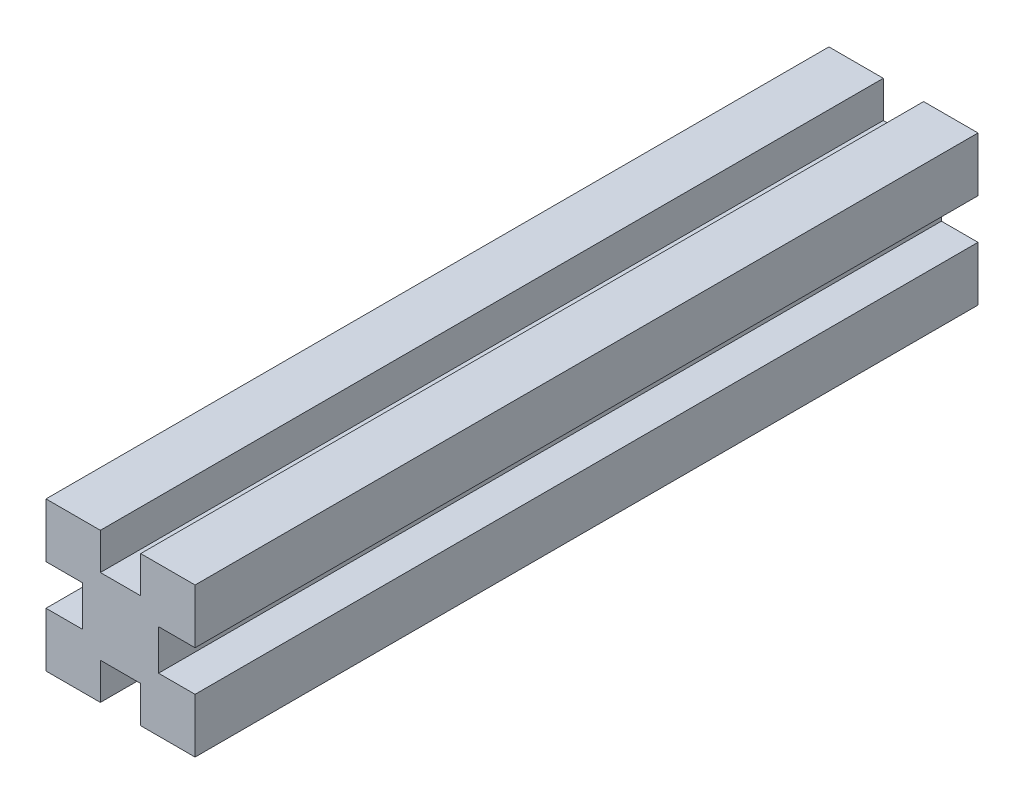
ISO-10303-21;
HEADER;
FILE_DESCRIPTION(('STEP AP214'),'2;1');
FILE_NAME('part.step','',(''),(''),'','','');
FILE_SCHEMA(('AUTOMOTIVE_DESIGN { 1 0 10303 214 1 1 1 1 }'));
ENDSEC;
DATA;
#1=APPLICATION_CONTEXT('core data for automotive mechanical design processes');
#2=APPLICATION_PROTOCOL_DEFINITION('international standard','automotive_design',2000,#1);
#3=PRODUCT_CONTEXT('',#1,'mechanical');
#4=PRODUCT('Part','Part','',(#3));
#5=PRODUCT_RELATED_PRODUCT_CATEGORY('part','',(#4));
#6=PRODUCT_DEFINITION_FORMATION('','',#4);
#7=PRODUCT_DEFINITION_CONTEXT('part definition',#1,'design');
#8=PRODUCT_DEFINITION('design','',#6,#7);
#9=PRODUCT_DEFINITION_SHAPE('','',#8);
#10=(LENGTH_UNIT() NAMED_UNIT(*) SI_UNIT(.MILLI.,.METRE.));
#11=(NAMED_UNIT(*) PLANE_ANGLE_UNIT() SI_UNIT($,.RADIAN.));
#12=(NAMED_UNIT(*) SI_UNIT($,.STERADIAN.) SOLID_ANGLE_UNIT());
#13=UNCERTAINTY_MEASURE_WITH_UNIT(LENGTH_MEASURE(1.E-05),#10,'distance_accuracy_value','');
#14=(GEOMETRIC_REPRESENTATION_CONTEXT(3) GLOBAL_UNCERTAINTY_ASSIGNED_CONTEXT((#13)) GLOBAL_UNIT_ASSIGNED_CONTEXT((#10,
#11,#12)) REPRESENTATION_CONTEXT('',''));
#15=CARTESIAN_POINT('',(0.,0.,0.));
#16=DIRECTION('',(0.,0.,1.));
#17=DIRECTION('',(1.,0.,0.));
#18=AXIS2_PLACEMENT_3D('',#15,#16,#17);
#19=CARTESIAN_POINT('',(0.,0.,167.));
#20=DIRECTION('',(0.,1.,0.));
#21=DIRECTION('',(0.,0.,1.));
#22=AXIS2_PLACEMENT_3D('',#19,#20,#21);
#23=PLANE('',#22);
#24=DIRECTION('',(1.,0.,0.));
#25=VECTOR('',#24,1.);
#26=CARTESIAN_POINT('',(0.,0.,0.));
#27=LINE('',#26,#25);
#28=CARTESIAN_POINT('',(0.,0.,0.));
#29=VERTEX_POINT('',#28);
#30=CARTESIAN_POINT('',(11.6,0.,0.));
#31=VERTEX_POINT('',#30);
#32=EDGE_CURVE('E200',#29,#31,#27,.T.);
#33=ORIENTED_EDGE('',*,*,#32,.T.);
#34=DIRECTION('',(0.,0.,-1.));
#35=VECTOR('',#34,1.);
#36=CARTESIAN_POINT('',(11.6,0.,167.));
#37=LINE('',#36,#35);
#38=CARTESIAN_POINT('',(11.6,0.,167.));
#39=VERTEX_POINT('',#38);
#40=EDGE_CURVE('E11',#39,#31,#37,.T.);
#41=ORIENTED_EDGE('',*,*,#40,.F.);
#42=DIRECTION('',(1.,0.,0.));
#43=VECTOR('',#42,1.);
#44=CARTESIAN_POINT('',(0.,0.,167.));
#45=LINE('',#44,#43);
#46=CARTESIAN_POINT('',(0.,0.,167.));
#47=VERTEX_POINT('',#46);
#48=EDGE_CURVE('E238',#47,#39,#45,.T.);
#49=ORIENTED_EDGE('',*,*,#48,.F.);
#50=DIRECTION('',(0.,0.,-1.));
#51=VECTOR('',#50,1.);
#52=CARTESIAN_POINT('',(0.,0.,167.));
#53=LINE('',#52,#51);
#54=EDGE_CURVE('E196',#47,#29,#53,.T.);
#55=ORIENTED_EDGE('',*,*,#54,.T.);
#56=EDGE_LOOP('',(#33,#41,#49,#55));
#57=FACE_BOUND('',#56,.T.);
#58=ADVANCED_FACE('F32',(#57),#23,.F.);
#59=CARTESIAN_POINT('',(11.6,0.,167.));
#60=DIRECTION('',(-1.,0.,0.));
#61=DIRECTION('',(0.,-1.,0.));
#62=AXIS2_PLACEMENT_3D('',#59,#60,#61);
#63=PLANE('',#62);
#64=DIRECTION('',(0.,1.,0.));
#65=VECTOR('',#64,1.);
#66=CARTESIAN_POINT('',(11.6,0.,0.));
#67=LINE('',#66,#65);
#68=CARTESIAN_POINT('',(11.6,7.8,0.));
#69=VERTEX_POINT('',#68);
#70=EDGE_CURVE('E203',#31,#69,#67,.T.);
#71=ORIENTED_EDGE('',*,*,#70,.T.);
#72=DIRECTION('',(0.,0.,-1.));
#73=VECTOR('',#72,1.);
#74=CARTESIAN_POINT('',(11.6,7.8,167.));
#75=LINE('',#74,#73);
#76=CARTESIAN_POINT('',(11.6,7.8,167.));
#77=VERTEX_POINT('',#76);
#78=EDGE_CURVE('E40',#77,#69,#75,.T.);
#79=ORIENTED_EDGE('',*,*,#78,.F.);
#80=DIRECTION('',(0.,1.,0.));
#81=VECTOR('',#80,1.);
#82=CARTESIAN_POINT('',(11.6,0.,167.));
#83=LINE('',#82,#81);
#84=EDGE_CURVE('E127',#39,#77,#83,.T.);
#85=ORIENTED_EDGE('',*,*,#84,.F.);
#86=ORIENTED_EDGE('',*,*,#40,.T.);
#87=EDGE_LOOP('',(#71,#79,#85,#86));
#88=FACE_BOUND('',#87,.T.);
#89=ADVANCED_FACE('F356',(#88),#63,.F.);
#90=CARTESIAN_POINT('',(11.6,7.8,167.));
#91=DIRECTION('',(0.,1.,0.));
#92=DIRECTION('',(-1.,0.,0.));
#93=AXIS2_PLACEMENT_3D('',#90,#91,#92);
#94=PLANE('',#93);
#95=DIRECTION('',(1.,0.,0.));
#96=VECTOR('',#95,1.);
#97=CARTESIAN_POINT('',(11.6,7.8,0.));
#98=LINE('',#97,#96);
#99=CARTESIAN_POINT('',(20.2,7.8,0.));
#100=VERTEX_POINT('',#99);
#101=EDGE_CURVE('E205',#69,#100,#98,.T.);
#102=ORIENTED_EDGE('',*,*,#101,.T.);
#103=DIRECTION('',(0.,0.,-1.));
#104=VECTOR('',#103,1.);
#105=CARTESIAN_POINT('',(20.2,7.8,167.));
#106=LINE('',#105,#104);
#107=CARTESIAN_POINT('',(20.2,7.8,167.));
#108=VERTEX_POINT('',#107);
#109=EDGE_CURVE('E281',#108,#100,#106,.T.);
#110=ORIENTED_EDGE('',*,*,#109,.F.);
#111=DIRECTION('',(1.,0.,0.));
#112=VECTOR('',#111,1.);
#113=CARTESIAN_POINT('',(11.6,7.8,167.));
#114=LINE('',#113,#112);
#115=EDGE_CURVE('E289',#77,#108,#114,.T.);
#116=ORIENTED_EDGE('',*,*,#115,.F.);
#117=ORIENTED_EDGE('',*,*,#78,.T.);
#118=EDGE_LOOP('',(#102,#110,#116,#117));
#119=FACE_BOUND('',#118,.T.);
#120=ADVANCED_FACE('F287',(#119),#94,.F.);
#121=CARTESIAN_POINT('',(20.2,7.8,167.));
#122=DIRECTION('',(1.,0.,0.));
#123=DIRECTION('',(0.,0.,-1.));
#124=AXIS2_PLACEMENT_3D('',#121,#122,#123);
#125=PLANE('',#124);
#126=DIRECTION('',(0.,-1.,0.));
#127=VECTOR('',#126,1.);
#128=CARTESIAN_POINT('',(20.2,7.8,0.));
#129=LINE('',#128,#127);
#130=CARTESIAN_POINT('',(20.2,0.,0.));
#131=VERTEX_POINT('',#130);
#132=EDGE_CURVE('E207',#100,#131,#129,.T.);
#133=ORIENTED_EDGE('',*,*,#132,.T.);
#134=DIRECTION('',(0.,0.,-1.));
#135=VECTOR('',#134,1.);
#136=CARTESIAN_POINT('',(20.2,0.,167.));
#137=LINE('',#136,#135);
#138=CARTESIAN_POINT('',(20.2,0.,167.));
#139=VERTEX_POINT('',#138);
#140=EDGE_CURVE('E278',#139,#131,#137,.T.);
#141=ORIENTED_EDGE('',*,*,#140,.F.);
#142=DIRECTION('',(0.,-1.,0.));
#143=VECTOR('',#142,1.);
#144=CARTESIAN_POINT('',(20.2,7.8,167.));
#145=LINE('',#144,#143);
#146=EDGE_CURVE('E307',#108,#139,#145,.T.);
#147=ORIENTED_EDGE('',*,*,#146,.F.);
#148=ORIENTED_EDGE('',*,*,#109,.T.);
#149=EDGE_LOOP('',(#133,#141,#147,#148));
#150=FACE_BOUND('',#149,.T.);
#151=ADVANCED_FACE('F298',(#150),#125,.F.);
#152=CARTESIAN_POINT('',(20.2,0.,167.));
#153=DIRECTION('',(0.,1.,0.));
#154=DIRECTION('',(0.,0.,1.));
#155=AXIS2_PLACEMENT_3D('',#152,#153,#154);
#156=PLANE('',#155);
#157=DIRECTION('',(1.,0.,0.));
#158=VECTOR('',#157,1.);
#159=CARTESIAN_POINT('',(20.2,0.,0.));
#160=LINE('',#159,#158);
#161=CARTESIAN_POINT('',(31.8,0.,0.));
#162=VERTEX_POINT('',#161);
#163=EDGE_CURVE('E209',#131,#162,#160,.T.);
#164=ORIENTED_EDGE('',*,*,#163,.T.);
#165=DIRECTION('',(0.,0.,-1.));
#166=VECTOR('',#165,1.);
#167=CARTESIAN_POINT('',(31.8,0.,167.));
#168=LINE('',#167,#166);
#169=CARTESIAN_POINT('',(31.8,0.,167.));
#170=VERTEX_POINT('',#169);
#171=EDGE_CURVE('E275',#170,#162,#168,.T.);
#172=ORIENTED_EDGE('',*,*,#171,.F.);
#173=DIRECTION('',(1.,0.,0.));
#174=VECTOR('',#173,1.);
#175=CARTESIAN_POINT('',(20.2,0.,167.));
#176=LINE('',#175,#174);
#177=EDGE_CURVE('E304',#139,#170,#176,.T.);
#178=ORIENTED_EDGE('',*,*,#177,.F.);
#179=ORIENTED_EDGE('',*,*,#140,.T.);
#180=EDGE_LOOP('',(#164,#172,#178,#179));
#181=FACE_BOUND('',#180,.T.);
#182=ADVANCED_FACE('F302',(#181),#156,.F.);
#183=CARTESIAN_POINT('',(31.8,11.6,167.));
#184=DIRECTION('',(-1.,0.,0.));
#185=DIRECTION('',(0.,0.,1.));
#186=AXIS2_PLACEMENT_3D('',#183,#184,#185);
#187=PLANE('',#186);
#188=DIRECTION('',(0.,1.,0.));
#189=VECTOR('',#188,1.);
#190=CARTESIAN_POINT('',(31.8,11.6,0.));
#191=LINE('',#190,#189);
#192=CARTESIAN_POINT('',(31.8,11.6,0.));
#193=VERTEX_POINT('',#192);
#194=EDGE_CURVE('E211',#162,#193,#191,.T.);
#195=ORIENTED_EDGE('',*,*,#194,.T.);
#196=DIRECTION('',(0.,0.,-1.));
#197=VECTOR('',#196,1.);
#198=CARTESIAN_POINT('',(31.8,11.6,167.));
#199=LINE('',#198,#197);
#200=CARTESIAN_POINT('',(31.8,11.6,167.));
#201=VERTEX_POINT('',#200);
#202=EDGE_CURVE('E272',#201,#193,#199,.T.);
#203=ORIENTED_EDGE('',*,*,#202,.F.);
#204=DIRECTION('',(0.,1.,0.));
#205=VECTOR('',#204,1.);
#206=CARTESIAN_POINT('',(31.8,11.6,167.));
#207=LINE('',#206,#205);
#208=EDGE_CURVE('E306',#170,#201,#207,.T.);
#209=ORIENTED_EDGE('',*,*,#208,.F.);
#210=ORIENTED_EDGE('',*,*,#171,.T.);
#211=EDGE_LOOP('',(#195,#203,#209,#210));
#212=FACE_BOUND('',#211,.T.);
#213=ADVANCED_FACE('F369',(#212),#187,.F.);
#214=CARTESIAN_POINT('',(24.,11.6,167.));
#215=DIRECTION('',(0.,-1.,0.));
#216=DIRECTION('',(0.,0.,-1.));
#217=AXIS2_PLACEMENT_3D('',#214,#215,#216);
#218=PLANE('',#217);
#219=DIRECTION('',(-1.,0.,0.));
#220=VECTOR('',#219,1.);
#221=CARTESIAN_POINT('',(24.,11.6,0.));
#222=LINE('',#221,#220);
#223=CARTESIAN_POINT('',(24.,11.6,0.));
#224=VERTEX_POINT('',#223);
#225=EDGE_CURVE('E213',#193,#224,#222,.T.);
#226=ORIENTED_EDGE('',*,*,#225,.T.);
#227=DIRECTION('',(0.,0.,-1.));
#228=VECTOR('',#227,1.);
#229=CARTESIAN_POINT('',(24.,11.6,167.));
#230=LINE('',#229,#228);
#231=CARTESIAN_POINT('',(24.,11.6,167.));
#232=VERTEX_POINT('',#231);
#233=EDGE_CURVE('E269',#232,#224,#230,.T.);
#234=ORIENTED_EDGE('',*,*,#233,.F.);
#235=DIRECTION('',(-1.,0.,0.));
#236=VECTOR('',#235,1.);
#237=CARTESIAN_POINT('',(24.,11.6,167.));
#238=LINE('',#237,#236);
#239=EDGE_CURVE('E309',#201,#232,#238,.T.);
#240=ORIENTED_EDGE('',*,*,#239,.F.);
#241=ORIENTED_EDGE('',*,*,#202,.T.);
#242=EDGE_LOOP('',(#226,#234,#240,#241));
#243=FACE_BOUND('',#242,.T.);
#244=ADVANCED_FACE('F372',(#243),#218,.F.);
#245=CARTESIAN_POINT('',(24.,20.2,167.));
#246=DIRECTION('',(-1.,0.,0.));
#247=DIRECTION('',(0.,0.,1.));
#248=AXIS2_PLACEMENT_3D('',#245,#246,#247);
#249=PLANE('',#248);
#250=DIRECTION('',(0.,1.,0.));
#251=VECTOR('',#250,1.);
#252=CARTESIAN_POINT('',(24.,20.2,0.));
#253=LINE('',#252,#251);
#254=CARTESIAN_POINT('',(24.,20.2,0.));
#255=VERTEX_POINT('',#254);
#256=EDGE_CURVE('E215',#224,#255,#253,.T.);
#257=ORIENTED_EDGE('',*,*,#256,.T.);
#258=DIRECTION('',(0.,0.,-1.));
#259=VECTOR('',#258,1.);
#260=CARTESIAN_POINT('',(24.,20.2,167.));
#261=LINE('',#260,#259);
#262=CARTESIAN_POINT('',(24.,20.2,167.));
#263=VERTEX_POINT('',#262);
#264=EDGE_CURVE('E266',#263,#255,#261,.T.);
#265=ORIENTED_EDGE('',*,*,#264,.F.);
#266=DIRECTION('',(0.,1.,0.));
#267=VECTOR('',#266,1.);
#268=CARTESIAN_POINT('',(24.,20.2,167.));
#269=LINE('',#268,#267);
#270=EDGE_CURVE('E315',#232,#263,#269,.T.);
#271=ORIENTED_EDGE('',*,*,#270,.F.);
#272=ORIENTED_EDGE('',*,*,#233,.T.);
#273=EDGE_LOOP('',(#257,#265,#271,#272));
#274=FACE_BOUND('',#273,.T.);
#275=ADVANCED_FACE('F376',(#274),#249,.F.);
#276=CARTESIAN_POINT('',(31.8,20.2,167.));
#277=DIRECTION('',(0.,1.,0.));
#278=DIRECTION('',(0.,0.,1.));
#279=AXIS2_PLACEMENT_3D('',#276,#277,#278);
#280=PLANE('',#279);
#281=DIRECTION('',(1.,0.,0.));
#282=VECTOR('',#281,1.);
#283=CARTESIAN_POINT('',(31.8,20.2,0.));
#284=LINE('',#283,#282);
#285=CARTESIAN_POINT('',(31.8,20.2,0.));
#286=VERTEX_POINT('',#285);
#287=EDGE_CURVE('E217',#255,#286,#284,.T.);
#288=ORIENTED_EDGE('',*,*,#287,.T.);
#289=DIRECTION('',(0.,0.,-1.));
#290=VECTOR('',#289,1.);
#291=CARTESIAN_POINT('',(31.8,20.2,167.));
#292=LINE('',#291,#290);
#293=CARTESIAN_POINT('',(31.8,20.2,167.));
#294=VERTEX_POINT('',#293);
#295=EDGE_CURVE('E263',#294,#286,#292,.T.);
#296=ORIENTED_EDGE('',*,*,#295,.F.);
#297=DIRECTION('',(1.,0.,0.));
#298=VECTOR('',#297,1.);
#299=CARTESIAN_POINT('',(31.8,20.2,167.));
#300=LINE('',#299,#298);
#301=EDGE_CURVE('E317',#263,#294,#300,.T.);
#302=ORIENTED_EDGE('',*,*,#301,.F.);
#303=ORIENTED_EDGE('',*,*,#264,.T.);
#304=EDGE_LOOP('',(#288,#296,#302,#303));
#305=FACE_BOUND('',#304,.T.);
#306=ADVANCED_FACE('F380',(#305),#280,.F.);
#307=CARTESIAN_POINT('',(31.8,31.8,167.));
#308=DIRECTION('',(-1.,0.,0.));
#309=DIRECTION('',(0.,-1.,0.));
#310=AXIS2_PLACEMENT_3D('',#307,#308,#309);
#311=PLANE('',#310);
#312=DIRECTION('',(0.,1.,0.));
#313=VECTOR('',#312,1.);
#314=CARTESIAN_POINT('',(31.8,31.8,0.));
#315=LINE('',#314,#313);
#316=CARTESIAN_POINT('',(31.8,31.8,0.));
#317=VERTEX_POINT('',#316);
#318=EDGE_CURVE('E219',#286,#317,#315,.T.);
#319=ORIENTED_EDGE('',*,*,#318,.T.);
#320=DIRECTION('',(0.,0.,-1.));
#321=VECTOR('',#320,1.);
#322=CARTESIAN_POINT('',(31.8,31.8,167.));
#323=LINE('',#322,#321);
#324=CARTESIAN_POINT('',(31.8,31.8,167.));
#325=VERTEX_POINT('',#324);
#326=EDGE_CURVE('E260',#325,#317,#323,.T.);
#327=ORIENTED_EDGE('',*,*,#326,.F.);
#328=DIRECTION('',(0.,1.,0.));
#329=VECTOR('',#328,1.);
#330=CARTESIAN_POINT('',(31.8,31.8,167.));
#331=LINE('',#330,#329);
#332=EDGE_CURVE('E319',#294,#325,#331,.T.);
#333=ORIENTED_EDGE('',*,*,#332,.F.);
#334=ORIENTED_EDGE('',*,*,#295,.T.);
#335=EDGE_LOOP('',(#319,#327,#333,#334));
#336=FACE_BOUND('',#335,.T.);
#337=ADVANCED_FACE('F384',(#336),#311,.F.);
#338=CARTESIAN_POINT('',(20.2,31.8,167.));
#339=DIRECTION('',(0.,-1.,0.));
#340=DIRECTION('',(0.,0.,-1.));
#341=AXIS2_PLACEMENT_3D('',#338,#339,#340);
#342=PLANE('',#341);
#343=DIRECTION('',(-1.,0.,0.));
#344=VECTOR('',#343,1.);
#345=CARTESIAN_POINT('',(20.2,31.8,0.));
#346=LINE('',#345,#344);
#347=CARTESIAN_POINT('',(20.2,31.8,0.));
#348=VERTEX_POINT('',#347);
#349=EDGE_CURVE('E221',#317,#348,#346,.T.);
#350=ORIENTED_EDGE('',*,*,#349,.T.);
#351=DIRECTION('',(0.,0.,-1.));
#352=VECTOR('',#351,1.);
#353=CARTESIAN_POINT('',(20.2,31.8,167.));
#354=LINE('',#353,#352);
#355=CARTESIAN_POINT('',(20.2,31.8,167.));
#356=VERTEX_POINT('',#355);
#357=EDGE_CURVE('E257',#356,#348,#354,.T.);
#358=ORIENTED_EDGE('',*,*,#357,.F.);
#359=DIRECTION('',(-1.,0.,0.));
#360=VECTOR('',#359,1.);
#361=CARTESIAN_POINT('',(20.2,31.8,167.));
#362=LINE('',#361,#360);
#363=EDGE_CURVE('E321',#325,#356,#362,.T.);
#364=ORIENTED_EDGE('',*,*,#363,.F.);
#365=ORIENTED_EDGE('',*,*,#326,.T.);
#366=EDGE_LOOP('',(#350,#358,#364,#365));
#367=FACE_BOUND('',#366,.T.);
#368=ADVANCED_FACE('F388',(#367),#342,.F.);
#369=CARTESIAN_POINT('',(20.2,24.,167.));
#370=DIRECTION('',(1.,0.,0.));
#371=DIRECTION('',(0.,1.,0.));
#372=AXIS2_PLACEMENT_3D('',#369,#370,#371);
#373=PLANE('',#372);
#374=DIRECTION('',(0.,-1.,0.));
#375=VECTOR('',#374,1.);
#376=CARTESIAN_POINT('',(20.2,24.,0.));
#377=LINE('',#376,#375);
#378=CARTESIAN_POINT('',(20.2,24.,0.));
#379=VERTEX_POINT('',#378);
#380=EDGE_CURVE('E223',#348,#379,#377,.T.);
#381=ORIENTED_EDGE('',*,*,#380,.T.);
#382=DIRECTION('',(0.,0.,-1.));
#383=VECTOR('',#382,1.);
#384=CARTESIAN_POINT('',(20.2,24.,167.));
#385=LINE('',#384,#383);
#386=CARTESIAN_POINT('',(20.2,24.,167.));
#387=VERTEX_POINT('',#386);
#388=EDGE_CURVE('E254',#387,#379,#385,.T.);
#389=ORIENTED_EDGE('',*,*,#388,.F.);
#390=DIRECTION('',(0.,-1.,0.));
#391=VECTOR('',#390,1.);
#392=CARTESIAN_POINT('',(20.2,24.,167.));
#393=LINE('',#392,#391);
#394=EDGE_CURVE('E323',#356,#387,#393,.T.);
#395=ORIENTED_EDGE('',*,*,#394,.F.);
#396=ORIENTED_EDGE('',*,*,#357,.T.);
#397=EDGE_LOOP('',(#381,#389,#395,#396));
#398=FACE_BOUND('',#397,.T.);
#399=ADVANCED_FACE('F392',(#398),#373,.F.);
#400=CARTESIAN_POINT('',(11.6,24.,167.));
#401=DIRECTION('',(0.,-1.,0.));
#402=DIRECTION('',(0.,0.,-1.));
#403=AXIS2_PLACEMENT_3D('',#400,#401,#402);
#404=PLANE('',#403);
#405=DIRECTION('',(-1.,0.,0.));
#406=VECTOR('',#405,1.);
#407=CARTESIAN_POINT('',(11.6,24.,0.));
#408=LINE('',#407,#406);
#409=CARTESIAN_POINT('',(11.6,24.,0.));
#410=VERTEX_POINT('',#409);
#411=EDGE_CURVE('E225',#379,#410,#408,.T.);
#412=ORIENTED_EDGE('',*,*,#411,.T.);
#413=DIRECTION('',(0.,0.,-1.));
#414=VECTOR('',#413,1.);
#415=CARTESIAN_POINT('',(11.6,24.,167.));
#416=LINE('',#415,#414);
#417=CARTESIAN_POINT('',(11.6,24.,167.));
#418=VERTEX_POINT('',#417);
#419=EDGE_CURVE('E251',#418,#410,#416,.T.);
#420=ORIENTED_EDGE('',*,*,#419,.F.);
#421=DIRECTION('',(-1.,0.,0.));
#422=VECTOR('',#421,1.);
#423=CARTESIAN_POINT('',(11.6,24.,167.));
#424=LINE('',#423,#422);
#425=EDGE_CURVE('E325',#387,#418,#424,.T.);
#426=ORIENTED_EDGE('',*,*,#425,.F.);
#427=ORIENTED_EDGE('',*,*,#388,.T.);
#428=EDGE_LOOP('',(#412,#420,#426,#427));
#429=FACE_BOUND('',#428,.T.);
#430=ADVANCED_FACE('F396',(#429),#404,.F.);
#431=CARTESIAN_POINT('',(11.6,31.8,167.));
#432=DIRECTION('',(-1.,0.,0.));
#433=DIRECTION('',(0.,-1.,0.));
#434=AXIS2_PLACEMENT_3D('',#431,#432,#433);
#435=PLANE('',#434);
#436=DIRECTION('',(0.,1.,0.));
#437=VECTOR('',#436,1.);
#438=CARTESIAN_POINT('',(11.6,31.8,0.));
#439=LINE('',#438,#437);
#440=CARTESIAN_POINT('',(11.6,31.8,0.));
#441=VERTEX_POINT('',#440);
#442=EDGE_CURVE('E227',#410,#441,#439,.T.);
#443=ORIENTED_EDGE('',*,*,#442,.T.);
#444=DIRECTION('',(0.,0.,-1.));
#445=VECTOR('',#444,1.);
#446=CARTESIAN_POINT('',(11.6,31.8,167.));
#447=LINE('',#446,#445);
#448=CARTESIAN_POINT('',(11.6,31.8,167.));
#449=VERTEX_POINT('',#448);
#450=EDGE_CURVE('E248',#449,#441,#447,.T.);
#451=ORIENTED_EDGE('',*,*,#450,.F.);
#452=DIRECTION('',(0.,1.,0.));
#453=VECTOR('',#452,1.);
#454=CARTESIAN_POINT('',(11.6,31.8,167.));
#455=LINE('',#454,#453);
#456=EDGE_CURVE('E327',#418,#449,#455,.T.);
#457=ORIENTED_EDGE('',*,*,#456,.F.);
#458=ORIENTED_EDGE('',*,*,#419,.T.);
#459=EDGE_LOOP('',(#443,#451,#457,#458));
#460=FACE_BOUND('',#459,.T.);
#461=ADVANCED_FACE('F400',(#460),#435,.F.);
#462=CARTESIAN_POINT('',(0.,31.8,167.));
#463=DIRECTION('',(0.,-1.,0.));
#464=DIRECTION('',(0.,0.,-1.));
#465=AXIS2_PLACEMENT_3D('',#462,#463,#464);
#466=PLANE('',#465);
#467=DIRECTION('',(-1.,0.,0.));
#468=VECTOR('',#467,1.);
#469=CARTESIAN_POINT('',(0.,31.8,0.));
#470=LINE('',#469,#468);
#471=CARTESIAN_POINT('',(0.,31.8,0.));
#472=VERTEX_POINT('',#471);
#473=EDGE_CURVE('E229',#441,#472,#470,.T.);
#474=ORIENTED_EDGE('',*,*,#473,.T.);
#475=DIRECTION('',(0.,0.,-1.));
#476=VECTOR('',#475,1.);
#477=CARTESIAN_POINT('',(0.,31.8,167.));
#478=LINE('',#477,#476);
#479=CARTESIAN_POINT('',(0.,31.8,167.));
#480=VERTEX_POINT('',#479);
#481=EDGE_CURVE('E245',#480,#472,#478,.T.);
#482=ORIENTED_EDGE('',*,*,#481,.F.);
#483=DIRECTION('',(-1.,0.,0.));
#484=VECTOR('',#483,1.);
#485=CARTESIAN_POINT('',(0.,31.8,167.));
#486=LINE('',#485,#484);
#487=EDGE_CURVE('E329',#449,#480,#486,.T.);
#488=ORIENTED_EDGE('',*,*,#487,.F.);
#489=ORIENTED_EDGE('',*,*,#450,.T.);
#490=EDGE_LOOP('',(#474,#482,#488,#489));
#491=FACE_BOUND('',#490,.T.);
#492=ADVANCED_FACE('F404',(#491),#466,.F.);
#493=CARTESIAN_POINT('',(0.,20.2,167.));
#494=DIRECTION('',(1.,0.,0.));
#495=DIRECTION('',(0.,1.,0.));
#496=AXIS2_PLACEMENT_3D('',#493,#494,#495);
#497=PLANE('',#496);
#498=DIRECTION('',(0.,-1.,0.));
#499=VECTOR('',#498,1.);
#500=CARTESIAN_POINT('',(0.,20.2,0.));
#501=LINE('',#500,#499);
#502=CARTESIAN_POINT('',(0.,20.2,0.));
#503=VERTEX_POINT('',#502);
#504=EDGE_CURVE('E231',#472,#503,#501,.T.);
#505=ORIENTED_EDGE('',*,*,#504,.T.);
#506=DIRECTION('',(0.,0.,-1.));
#507=VECTOR('',#506,1.);
#508=CARTESIAN_POINT('',(0.,20.2,167.));
#509=LINE('',#508,#507);
#510=CARTESIAN_POINT('',(0.,20.2,167.));
#511=VERTEX_POINT('',#510);
#512=EDGE_CURVE('E242',#511,#503,#509,.T.);
#513=ORIENTED_EDGE('',*,*,#512,.F.);
#514=DIRECTION('',(0.,-1.,0.));
#515=VECTOR('',#514,1.);
#516=CARTESIAN_POINT('',(0.,20.2,167.));
#517=LINE('',#516,#515);
#518=EDGE_CURVE('E331',#480,#511,#517,.T.);
#519=ORIENTED_EDGE('',*,*,#518,.F.);
#520=ORIENTED_EDGE('',*,*,#481,.T.);
#521=EDGE_LOOP('',(#505,#513,#519,#520));
#522=FACE_BOUND('',#521,.T.);
#523=ADVANCED_FACE('F337',(#522),#497,.F.);
#524=CARTESIAN_POINT('',(7.80000000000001,20.2,167.));
#525=DIRECTION('',(0.,1.,0.));
#526=DIRECTION('',(-1.,0.,0.));
#527=AXIS2_PLACEMENT_3D('',#524,#525,#526);
#528=PLANE('',#527);
#529=DIRECTION('',(1.,0.,0.));
#530=VECTOR('',#529,1.);
#531=CARTESIAN_POINT('',(7.80000000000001,20.2,0.));
#532=LINE('',#531,#530);
#533=CARTESIAN_POINT('',(7.80000000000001,20.2,0.));
#534=VERTEX_POINT('',#533);
#535=EDGE_CURVE('E233',#503,#534,#532,.T.);
#536=ORIENTED_EDGE('',*,*,#535,.T.);
#537=DIRECTION('',(0.,0.,-1.));
#538=VECTOR('',#537,1.);
#539=CARTESIAN_POINT('',(7.80000000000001,20.2,167.));
#540=LINE('',#539,#538);
#541=CARTESIAN_POINT('',(7.80000000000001,20.2,167.));
#542=VERTEX_POINT('',#541);
#543=EDGE_CURVE('E191',#542,#534,#540,.T.);
#544=ORIENTED_EDGE('',*,*,#543,.F.);
#545=DIRECTION('',(1.,0.,0.));
#546=VECTOR('',#545,1.);
#547=CARTESIAN_POINT('',(7.80000000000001,20.2,167.));
#548=LINE('',#547,#546);
#549=EDGE_CURVE('E182',#511,#542,#548,.T.);
#550=ORIENTED_EDGE('',*,*,#549,.F.);
#551=ORIENTED_EDGE('',*,*,#512,.T.);
#552=EDGE_LOOP('',(#536,#544,#550,#551));
#553=FACE_BOUND('',#552,.T.);
#554=ADVANCED_FACE('F341',(#553),#528,.F.);
#555=CARTESIAN_POINT('',(7.80000000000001,11.6,167.));
#556=DIRECTION('',(1.,0.,0.));
#557=DIRECTION('',(0.,0.,-1.));
#558=AXIS2_PLACEMENT_3D('',#555,#556,#557);
#559=PLANE('',#558);
#560=DIRECTION('',(0.,-1.,0.));
#561=VECTOR('',#560,1.);
#562=CARTESIAN_POINT('',(7.80000000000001,11.6,0.));
#563=LINE('',#562,#561);
#564=CARTESIAN_POINT('',(7.80000000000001,11.6,0.));
#565=VERTEX_POINT('',#564);
#566=EDGE_CURVE('E190',#534,#565,#563,.T.);
#567=ORIENTED_EDGE('',*,*,#566,.T.);
#568=DIRECTION('',(0.,0.,-1.));
#569=VECTOR('',#568,1.);
#570=CARTESIAN_POINT('',(7.80000000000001,11.6,167.));
#571=LINE('',#570,#569);
#572=CARTESIAN_POINT('',(7.80000000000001,11.6,167.));
#573=VERTEX_POINT('',#572);
#574=EDGE_CURVE('E187',#573,#565,#571,.T.);
#575=ORIENTED_EDGE('',*,*,#574,.F.);
#576=DIRECTION('',(0.,-1.,0.));
#577=VECTOR('',#576,1.);
#578=CARTESIAN_POINT('',(7.80000000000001,11.6,167.));
#579=LINE('',#578,#577);
#580=EDGE_CURVE('E176',#542,#573,#579,.T.);
#581=ORIENTED_EDGE('',*,*,#580,.F.);
#582=ORIENTED_EDGE('',*,*,#543,.T.);
#583=EDGE_LOOP('',(#567,#575,#581,#582));
#584=FACE_BOUND('',#583,.T.);
#585=ADVANCED_FACE('F188',(#584),#559,.F.);
#586=CARTESIAN_POINT('',(0.,11.6,167.));
#587=DIRECTION('',(0.,-1.,0.));
#588=DIRECTION('',(0.,0.,-1.));
#589=AXIS2_PLACEMENT_3D('',#586,#587,#588);
#590=PLANE('',#589);
#591=DIRECTION('',(-1.,0.,0.));
#592=VECTOR('',#591,1.);
#593=CARTESIAN_POINT('',(0.,11.6,0.));
#594=LINE('',#593,#592);
#595=CARTESIAN_POINT('',(0.,11.6,0.));
#596=VERTEX_POINT('',#595);
#597=EDGE_CURVE('E113',#565,#596,#594,.T.);
#598=ORIENTED_EDGE('',*,*,#597,.T.);
#599=DIRECTION('',(0.,0.,-1.));
#600=VECTOR('',#599,1.);
#601=CARTESIAN_POINT('',(0.,11.6,167.));
#602=LINE('',#601,#600);
#603=CARTESIAN_POINT('',(0.,11.6,167.));
#604=VERTEX_POINT('',#603);
#605=EDGE_CURVE('E192',#604,#596,#602,.T.);
#606=ORIENTED_EDGE('',*,*,#605,.F.);
#607=DIRECTION('',(-1.,0.,0.));
#608=VECTOR('',#607,1.);
#609=CARTESIAN_POINT('',(0.,11.6,167.));
#610=LINE('',#609,#608);
#611=EDGE_CURVE('E180',#573,#604,#610,.T.);
#612=ORIENTED_EDGE('',*,*,#611,.F.);
#613=ORIENTED_EDGE('',*,*,#574,.T.);
#614=EDGE_LOOP('',(#598,#606,#612,#613));
#615=FACE_BOUND('',#614,.T.);
#616=ADVANCED_FACE('F194',(#615),#590,.F.);
#617=CARTESIAN_POINT('',(0.,0.,167.));
#618=DIRECTION('',(1.,0.,0.));
#619=DIRECTION('',(0.,1.,0.));
#620=AXIS2_PLACEMENT_3D('',#617,#618,#619);
#621=PLANE('',#620);
#622=DIRECTION('',(0.,-1.,0.));
#623=VECTOR('',#622,1.);
#624=CARTESIAN_POINT('',(0.,0.,0.));
#625=LINE('',#624,#623);
#626=EDGE_CURVE('E119',#596,#29,#625,.T.);
#627=ORIENTED_EDGE('',*,*,#626,.T.);
#628=ORIENTED_EDGE('',*,*,#54,.F.);
#629=DIRECTION('',(0.,-1.,0.));
#630=VECTOR('',#629,1.);
#631=CARTESIAN_POINT('',(0.,0.,167.));
#632=LINE('',#631,#630);
#633=EDGE_CURVE('E48',#604,#47,#632,.T.);
#634=ORIENTED_EDGE('',*,*,#633,.F.);
#635=ORIENTED_EDGE('',*,*,#605,.T.);
#636=EDGE_LOOP('',(#627,#628,#634,#635));
#637=FACE_BOUND('',#636,.T.);
#638=ADVANCED_FACE('F345',(#637),#621,.F.);
#639=CARTESIAN_POINT('',(0.,0.,167.));
#640=DIRECTION('',(0.,0.,1.));
#641=DIRECTION('',(1.,0.,0.));
#642=AXIS2_PLACEMENT_3D('',#639,#640,#641);
#643=PLANE('',#642);
#644=ORIENTED_EDGE('',*,*,#48,.T.);
#645=ORIENTED_EDGE('',*,*,#84,.T.);
#646=ORIENTED_EDGE('',*,*,#115,.T.);
#647=ORIENTED_EDGE('',*,*,#146,.T.);
#648=ORIENTED_EDGE('',*,*,#177,.T.);
#649=ORIENTED_EDGE('',*,*,#208,.T.);
#650=ORIENTED_EDGE('',*,*,#239,.T.);
#651=ORIENTED_EDGE('',*,*,#270,.T.);
#652=ORIENTED_EDGE('',*,*,#301,.T.);
#653=ORIENTED_EDGE('',*,*,#332,.T.);
#654=ORIENTED_EDGE('',*,*,#363,.T.);
#655=ORIENTED_EDGE('',*,*,#394,.T.);
#656=ORIENTED_EDGE('',*,*,#425,.T.);
#657=ORIENTED_EDGE('',*,*,#456,.T.);
#658=ORIENTED_EDGE('',*,*,#487,.T.);
#659=ORIENTED_EDGE('',*,*,#518,.T.);
#660=ORIENTED_EDGE('',*,*,#549,.T.);
#661=ORIENTED_EDGE('',*,*,#580,.T.);
#662=ORIENTED_EDGE('',*,*,#611,.T.);
#663=ORIENTED_EDGE('',*,*,#633,.T.);
#664=EDGE_LOOP('',(#644,#645,#646,#647,#648,#649,#650,#651,#652,#653,#654,#655,#656,#657,#658,
#659,#660,#661,#662,#663));
#665=FACE_BOUND('',#664,.T.);
#666=ADVANCED_FACE('F178',(#665),#643,.T.);
#667=CARTESIAN_POINT('',(0.,0.,0.));
#668=DIRECTION('',(0.,0.,1.));
#669=DIRECTION('',(1.,0.,0.));
#670=AXIS2_PLACEMENT_3D('',#667,#668,#669);
#671=PLANE('',#670);
#672=ORIENTED_EDGE('',*,*,#32,.F.);
#673=ORIENTED_EDGE('',*,*,#626,.F.);
#674=ORIENTED_EDGE('',*,*,#597,.F.);
#675=ORIENTED_EDGE('',*,*,#566,.F.);
#676=ORIENTED_EDGE('',*,*,#535,.F.);
#677=ORIENTED_EDGE('',*,*,#504,.F.);
#678=ORIENTED_EDGE('',*,*,#473,.F.);
#679=ORIENTED_EDGE('',*,*,#442,.F.);
#680=ORIENTED_EDGE('',*,*,#411,.F.);
#681=ORIENTED_EDGE('',*,*,#380,.F.);
#682=ORIENTED_EDGE('',*,*,#349,.F.);
#683=ORIENTED_EDGE('',*,*,#318,.F.);
#684=ORIENTED_EDGE('',*,*,#287,.F.);
#685=ORIENTED_EDGE('',*,*,#256,.F.);
#686=ORIENTED_EDGE('',*,*,#225,.F.);
#687=ORIENTED_EDGE('',*,*,#194,.F.);
#688=ORIENTED_EDGE('',*,*,#163,.F.);
#689=ORIENTED_EDGE('',*,*,#132,.F.);
#690=ORIENTED_EDGE('',*,*,#101,.F.);
#691=ORIENTED_EDGE('',*,*,#70,.F.);
#692=EDGE_LOOP('',(#672,#673,#674,#675,#676,#677,#678,#679,#680,#681,#682,#683,#684,#685,#686,
#687,#688,#689,#690,#691));
#693=FACE_BOUND('',#692,.T.);
#694=ADVANCED_FACE('F293',(#693),#671,.F.);
#695=CLOSED_SHELL('',(#58,#89,#120,#151,#182,#213,#244,#275,#306,#337,#368,#399,#430,#461,#492,
#523,#554,#585,#616,#638,#666,#694));
#696=MANIFOLD_SOLID_BREP('B2',#695);
#697=ADVANCED_BREP_SHAPE_REPRESENTATION('',(#18,#696),#14);
#698=SHAPE_DEFINITION_REPRESENTATION(#9,#697);
ENDSEC;
END-ISO-10303-21;
